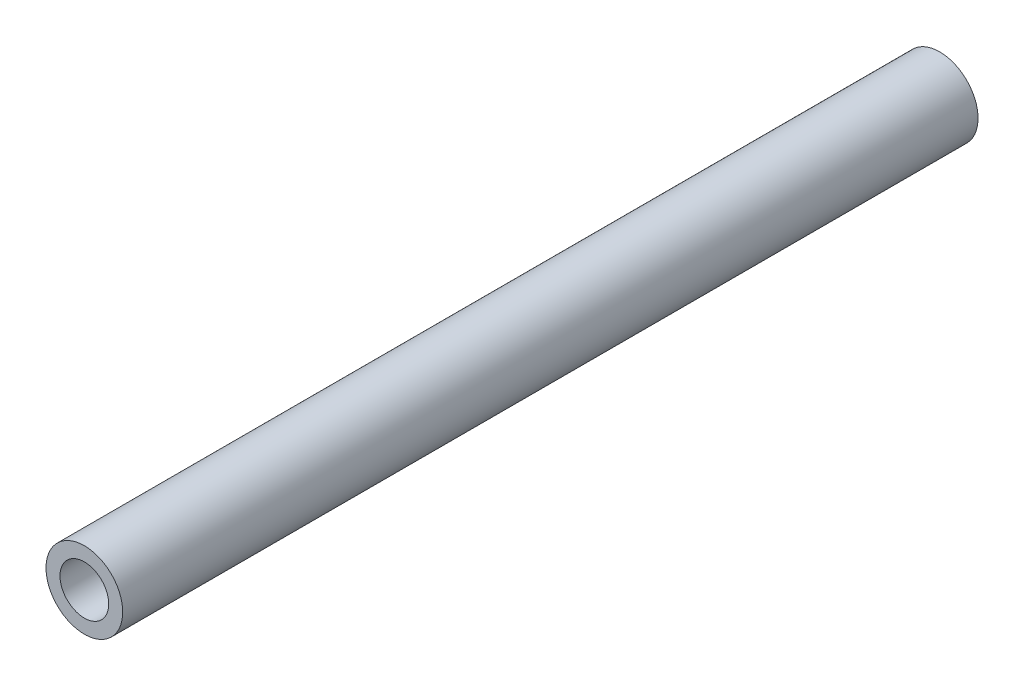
ISO-10303-21;
HEADER;
FILE_DESCRIPTION(('STEP AP214'),'2;1');
FILE_NAME('part.step','',(''),(''),'','','');
FILE_SCHEMA(('AUTOMOTIVE_DESIGN { 1 0 10303 214 1 1 1 1 }'));
ENDSEC;
DATA;
#1=APPLICATION_CONTEXT('core data for automotive mechanical design processes');
#2=APPLICATION_PROTOCOL_DEFINITION('international standard','automotive_design',2000,#1);
#3=PRODUCT_CONTEXT('',#1,'mechanical');
#4=PRODUCT('Part','Part','',(#3));
#5=PRODUCT_RELATED_PRODUCT_CATEGORY('part','',(#4));
#6=PRODUCT_DEFINITION_FORMATION('','',#4);
#7=PRODUCT_DEFINITION_CONTEXT('part definition',#1,'design');
#8=PRODUCT_DEFINITION('design','',#6,#7);
#9=PRODUCT_DEFINITION_SHAPE('','',#8);
#10=(LENGTH_UNIT() NAMED_UNIT(*) SI_UNIT(.MILLI.,.METRE.));
#11=(NAMED_UNIT(*) PLANE_ANGLE_UNIT() SI_UNIT($,.RADIAN.));
#12=(NAMED_UNIT(*) SI_UNIT($,.STERADIAN.) SOLID_ANGLE_UNIT());
#13=UNCERTAINTY_MEASURE_WITH_UNIT(LENGTH_MEASURE(1.E-05),#10,'distance_accuracy_value','');
#14=(GEOMETRIC_REPRESENTATION_CONTEXT(3) GLOBAL_UNCERTAINTY_ASSIGNED_CONTEXT((#13)) GLOBAL_UNIT_ASSIGNED_CONTEXT((#10,
#11,#12)) REPRESENTATION_CONTEXT('',''));
#15=CARTESIAN_POINT('',(0.,0.,0.));
#16=DIRECTION('',(0.,0.,1.));
#17=DIRECTION('',(1.,0.,0.));
#18=AXIS2_PLACEMENT_3D('',#15,#16,#17);
#19=CARTESIAN_POINT('',(0.,0.,111.5));
#20=DIRECTION('',(0.,0.,1.));
#21=DIRECTION('',(1.,0.,0.));
#22=AXIS2_PLACEMENT_3D('',#19,#20,#21);
#23=PLANE('',#22);
#24=CARTESIAN_POINT('',(0.,0.,111.5));
#25=DIRECTION('',(0.,0.,1.));
#26=DIRECTION('',(1.,0.,0.));
#27=AXIS2_PLACEMENT_3D('',#24,#25,#26);
#28=CIRCLE('',#27,5.);
#29=CARTESIAN_POINT('',(-5.,0.,111.5));
#30=VERTEX_POINT('',#29);
#31=EDGE_CURVE('E10',#30,#30,#28,.T.);
#32=ORIENTED_EDGE('',*,*,#31,.T.);
#33=EDGE_LOOP('',(#32));
#34=FACE_BOUND('',#33,.T.);
#35=CARTESIAN_POINT('',(0.,0.,111.5));
#36=DIRECTION('',(0.,0.,1.));
#37=DIRECTION('',(1.,0.,0.));
#38=AXIS2_PLACEMENT_3D('',#35,#36,#37);
#39=CIRCLE('',#38,3.175);
#40=CARTESIAN_POINT('',(-3.175,0.,111.5));
#41=VERTEX_POINT('',#40);
#42=EDGE_CURVE('E40',#41,#41,#39,.T.);
#43=ORIENTED_EDGE('',*,*,#42,.F.);
#44=EDGE_LOOP('',(#43));
#45=FACE_BOUND('',#44,.T.);
#46=ADVANCED_FACE('F29',(#34,#45),#23,.T.);
#47=CARTESIAN_POINT('',(0.,0.,0.));
#48=DIRECTION('',(0.,0.,1.));
#49=DIRECTION('',(1.,0.,0.));
#50=AXIS2_PLACEMENT_3D('',#47,#48,#49);
#51=PLANE('',#50);
#52=CARTESIAN_POINT('',(0.,0.,0.));
#53=DIRECTION('',(0.,0.,1.));
#54=DIRECTION('',(1.,0.,0.));
#55=AXIS2_PLACEMENT_3D('',#52,#53,#54);
#56=CIRCLE('',#55,5.);
#57=CARTESIAN_POINT('',(-5.,0.,0.));
#58=VERTEX_POINT('',#57);
#59=EDGE_CURVE('E33',#58,#58,#56,.T.);
#60=ORIENTED_EDGE('',*,*,#59,.F.);
#61=EDGE_LOOP('',(#60));
#62=FACE_BOUND('',#61,.T.);
#63=CARTESIAN_POINT('',(0.,0.,0.));
#64=DIRECTION('',(0.,0.,1.));
#65=DIRECTION('',(1.,0.,0.));
#66=AXIS2_PLACEMENT_3D('',#63,#64,#65);
#67=CIRCLE('',#66,3.175);
#68=CARTESIAN_POINT('',(-3.175,0.,0.));
#69=VERTEX_POINT('',#68);
#70=EDGE_CURVE('E42',#69,#69,#67,.T.);
#71=ORIENTED_EDGE('',*,*,#70,.T.);
#72=EDGE_LOOP('',(#71));
#73=FACE_BOUND('',#72,.T.);
#74=ADVANCED_FACE('F52',(#62,#73),#51,.F.);
#75=CARTESIAN_POINT('',(0.,0.,111.5));
#76=DIRECTION('',(0.,0.,-1.));
#77=DIRECTION('',(-1.,0.,0.));
#78=AXIS2_PLACEMENT_3D('',#75,#76,#77);
#79=CYLINDRICAL_SURFACE('',#78,5.);
#80=CARTESIAN_POINT('',(-5.,0.,111.5));
#81=CARTESIAN_POINT('',(-5.,0.,110.338541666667));
#82=CARTESIAN_POINT('',(-5.,0.,109.177083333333));
#83=CARTESIAN_POINT('',(-5.,0.,106.854166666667));
#84=CARTESIAN_POINT('',(-5.,0.,105.692708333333));
#85=CARTESIAN_POINT('',(-5.,0.,103.369791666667));
#86=CARTESIAN_POINT('',(-5.,0.,102.208333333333));
#87=CARTESIAN_POINT('',(-5.,0.,99.8854166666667));
#88=CARTESIAN_POINT('',(-5.,0.,98.7239583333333));
#89=CARTESIAN_POINT('',(-5.,0.,96.4010416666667));
#90=CARTESIAN_POINT('',(-5.,0.,95.2395833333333));
#91=CARTESIAN_POINT('',(-5.,0.,92.9166666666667));
#92=CARTESIAN_POINT('',(-5.,0.,91.7552083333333));
#93=CARTESIAN_POINT('',(-5.,0.,89.4322916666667));
#94=CARTESIAN_POINT('',(-5.,0.,88.2708333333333));
#95=CARTESIAN_POINT('',(-5.,0.,85.9479166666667));
#96=CARTESIAN_POINT('',(-5.,0.,84.7864583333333));
#97=CARTESIAN_POINT('',(-5.,0.,82.4635416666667));
#98=CARTESIAN_POINT('',(-5.,0.,81.3020833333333));
#99=CARTESIAN_POINT('',(-5.,0.,78.9791666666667));
#100=CARTESIAN_POINT('',(-5.,0.,77.8177083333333));
#101=CARTESIAN_POINT('',(-5.,0.,75.4947916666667));
#102=CARTESIAN_POINT('',(-5.,0.,74.3333333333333));
#103=CARTESIAN_POINT('',(-5.,0.,72.0104166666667));
#104=CARTESIAN_POINT('',(-5.,0.,70.8489583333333));
#105=CARTESIAN_POINT('',(-5.,0.,68.5260416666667));
#106=CARTESIAN_POINT('',(-5.,0.,67.3645833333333));
#107=CARTESIAN_POINT('',(-5.,0.,65.0416666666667));
#108=CARTESIAN_POINT('',(-5.,0.,63.8802083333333));
#109=CARTESIAN_POINT('',(-5.,0.,61.5572916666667));
#110=CARTESIAN_POINT('',(-5.,0.,60.3958333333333));
#111=CARTESIAN_POINT('',(-5.,0.,58.0729166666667));
#112=CARTESIAN_POINT('',(-5.,0.,56.9114583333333));
#113=CARTESIAN_POINT('',(-5.,0.,54.5885416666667));
#114=CARTESIAN_POINT('',(-5.,0.,53.4270833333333));
#115=CARTESIAN_POINT('',(-5.,0.,51.1041666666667));
#116=CARTESIAN_POINT('',(-5.,0.,49.9427083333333));
#117=CARTESIAN_POINT('',(-5.,0.,47.6197916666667));
#118=CARTESIAN_POINT('',(-5.,0.,46.4583333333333));
#119=CARTESIAN_POINT('',(-5.,0.,44.1354166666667));
#120=CARTESIAN_POINT('',(-5.,0.,42.9739583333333));
#121=CARTESIAN_POINT('',(-5.,0.,40.6510416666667));
#122=CARTESIAN_POINT('',(-5.,0.,39.4895833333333));
#123=CARTESIAN_POINT('',(-5.,0.,37.1666666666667));
#124=CARTESIAN_POINT('',(-5.,0.,36.0052083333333));
#125=CARTESIAN_POINT('',(-5.,0.,33.6822916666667));
#126=CARTESIAN_POINT('',(-5.,0.,32.5208333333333));
#127=CARTESIAN_POINT('',(-5.,0.,30.1979166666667));
#128=CARTESIAN_POINT('',(-5.,0.,29.0364583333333));
#129=CARTESIAN_POINT('',(-5.,0.,26.7135416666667));
#130=CARTESIAN_POINT('',(-5.,0.,25.5520833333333));
#131=CARTESIAN_POINT('',(-5.,0.,23.2291666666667));
#132=CARTESIAN_POINT('',(-5.,0.,22.0677083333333));
#133=CARTESIAN_POINT('',(-5.,0.,19.7447916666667));
#134=CARTESIAN_POINT('',(-5.,0.,18.5833333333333));
#135=CARTESIAN_POINT('',(-5.,0.,16.2604166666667));
#136=CARTESIAN_POINT('',(-5.,0.,15.0989583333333));
#137=CARTESIAN_POINT('',(-5.,0.,12.7760416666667));
#138=CARTESIAN_POINT('',(-5.,0.,11.6145833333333));
#139=CARTESIAN_POINT('',(-5.,0.,9.29166666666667));
#140=CARTESIAN_POINT('',(-5.,0.,8.13020833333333));
#141=CARTESIAN_POINT('',(-5.,0.,5.80729166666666));
#142=CARTESIAN_POINT('',(-5.,0.,4.64583333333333));
#143=CARTESIAN_POINT('',(-5.,0.,2.32291666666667));
#144=CARTESIAN_POINT('',(-5.,0.,1.16145833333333));
#145=CARTESIAN_POINT('',(-5.,0.,0.));
#146=B_SPLINE_CURVE_WITH_KNOTS('',3,(#80,#81,#82,#83,#84,#85,#86,#87,#88,#89,#90,#91,#92,#93,
#94,#95,#96,#97,#98,#99,#100,#101,#102,#103,#104,#105,#106,#107,#108,#109,#110,#111,#112,#113,
#114,#115,#116,#117,#118,#119,#120,#121,#122,#123,#124,#125,#126,#127,#128,#129,#130,#131,#132,
#133,#134,#135,#136,#137,#138,#139,#140,#141,#142,#143,#144,#145),.UNSPECIFIED.,.F.,.F.,(4,2,2,
2,2,2,2,2,2,2,2,2,2,2,2,2,2,2,2,2,2,2,2,2,2,2,2,2,2,2,2,2,4),(0.,3.48437500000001,
6.96875000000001,10.453125,13.9375,17.421875,20.90625,24.390625,27.875,31.359375,34.84375,
38.328125,41.8125,45.296875,48.78125,52.265625,55.75,59.234375,62.71875,66.203125,69.6875,
73.171875,76.65625,80.140625,83.625,87.109375,90.59375,94.078125,97.5625,101.046875,104.53125,
108.015625,111.5),.UNSPECIFIED.);
#147=EDGE_CURVE('BSEAM31',#30,#58,#146,.T.);
#148=ORIENTED_EDGE('',*,*,#31,.F.);
#149=ORIENTED_EDGE('',*,*,#59,.T.);
#150=ORIENTED_EDGE('',*,*,#147,.T.);
#151=ORIENTED_EDGE('',*,*,#147,.F.);
#152=EDGE_LOOP('',(#148,#150,#149,#151));
#153=FACE_BOUND('',#152,.T.);
#154=ADVANCED_FACE('F31',(#153),#79,.T.);
#155=CARTESIAN_POINT('',(0.,0.,111.5));
#156=DIRECTION('',(0.,0.,-1.));
#157=DIRECTION('',(-1.,0.,0.));
#158=AXIS2_PLACEMENT_3D('',#155,#156,#157);
#159=CYLINDRICAL_SURFACE('',#158,3.175);
#160=CARTESIAN_POINT('',(-3.175,0.,111.5));
#161=CARTESIAN_POINT('',(-3.175,0.,110.338541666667));
#162=CARTESIAN_POINT('',(-3.175,0.,109.177083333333));
#163=CARTESIAN_POINT('',(-3.175,0.,106.854166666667));
#164=CARTESIAN_POINT('',(-3.175,0.,105.692708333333));
#165=CARTESIAN_POINT('',(-3.175,0.,103.369791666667));
#166=CARTESIAN_POINT('',(-3.175,0.,102.208333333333));
#167=CARTESIAN_POINT('',(-3.175,0.,99.8854166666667));
#168=CARTESIAN_POINT('',(-3.175,0.,98.7239583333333));
#169=CARTESIAN_POINT('',(-3.175,0.,96.4010416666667));
#170=CARTESIAN_POINT('',(-3.175,0.,95.2395833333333));
#171=CARTESIAN_POINT('',(-3.175,0.,92.9166666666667));
#172=CARTESIAN_POINT('',(-3.175,0.,91.7552083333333));
#173=CARTESIAN_POINT('',(-3.175,0.,89.4322916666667));
#174=CARTESIAN_POINT('',(-3.175,0.,88.2708333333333));
#175=CARTESIAN_POINT('',(-3.175,0.,85.9479166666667));
#176=CARTESIAN_POINT('',(-3.175,0.,84.7864583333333));
#177=CARTESIAN_POINT('',(-3.175,0.,82.4635416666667));
#178=CARTESIAN_POINT('',(-3.175,0.,81.3020833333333));
#179=CARTESIAN_POINT('',(-3.175,0.,78.9791666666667));
#180=CARTESIAN_POINT('',(-3.175,0.,77.8177083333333));
#181=CARTESIAN_POINT('',(-3.175,0.,75.4947916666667));
#182=CARTESIAN_POINT('',(-3.175,0.,74.3333333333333));
#183=CARTESIAN_POINT('',(-3.175,0.,72.0104166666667));
#184=CARTESIAN_POINT('',(-3.175,0.,70.8489583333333));
#185=CARTESIAN_POINT('',(-3.175,0.,68.5260416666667));
#186=CARTESIAN_POINT('',(-3.175,0.,67.3645833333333));
#187=CARTESIAN_POINT('',(-3.175,0.,65.0416666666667));
#188=CARTESIAN_POINT('',(-3.175,0.,63.8802083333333));
#189=CARTESIAN_POINT('',(-3.175,0.,61.5572916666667));
#190=CARTESIAN_POINT('',(-3.175,0.,60.3958333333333));
#191=CARTESIAN_POINT('',(-3.175,0.,58.0729166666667));
#192=CARTESIAN_POINT('',(-3.175,0.,56.9114583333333));
#193=CARTESIAN_POINT('',(-3.175,0.,54.5885416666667));
#194=CARTESIAN_POINT('',(-3.175,0.,53.4270833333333));
#195=CARTESIAN_POINT('',(-3.175,0.,51.1041666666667));
#196=CARTESIAN_POINT('',(-3.175,0.,49.9427083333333));
#197=CARTESIAN_POINT('',(-3.175,0.,47.6197916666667));
#198=CARTESIAN_POINT('',(-3.175,0.,46.4583333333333));
#199=CARTESIAN_POINT('',(-3.175,0.,44.1354166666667));
#200=CARTESIAN_POINT('',(-3.175,0.,42.9739583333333));
#201=CARTESIAN_POINT('',(-3.175,0.,40.6510416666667));
#202=CARTESIAN_POINT('',(-3.175,0.,39.4895833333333));
#203=CARTESIAN_POINT('',(-3.175,0.,37.1666666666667));
#204=CARTESIAN_POINT('',(-3.175,0.,36.0052083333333));
#205=CARTESIAN_POINT('',(-3.175,0.,33.6822916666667));
#206=CARTESIAN_POINT('',(-3.175,0.,32.5208333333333));
#207=CARTESIAN_POINT('',(-3.175,0.,30.1979166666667));
#208=CARTESIAN_POINT('',(-3.175,0.,29.0364583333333));
#209=CARTESIAN_POINT('',(-3.175,0.,26.7135416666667));
#210=CARTESIAN_POINT('',(-3.175,0.,25.5520833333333));
#211=CARTESIAN_POINT('',(-3.175,0.,23.2291666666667));
#212=CARTESIAN_POINT('',(-3.175,0.,22.0677083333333));
#213=CARTESIAN_POINT('',(-3.175,0.,19.7447916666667));
#214=CARTESIAN_POINT('',(-3.175,0.,18.5833333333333));
#215=CARTESIAN_POINT('',(-3.175,0.,16.2604166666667));
#216=CARTESIAN_POINT('',(-3.175,0.,15.0989583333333));
#217=CARTESIAN_POINT('',(-3.175,0.,12.7760416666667));
#218=CARTESIAN_POINT('',(-3.175,0.,11.6145833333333));
#219=CARTESIAN_POINT('',(-3.175,0.,9.29166666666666));
#220=CARTESIAN_POINT('',(-3.175,0.,8.13020833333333));
#221=CARTESIAN_POINT('',(-3.175,0.,5.80729166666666));
#222=CARTESIAN_POINT('',(-3.175,0.,4.64583333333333));
#223=CARTESIAN_POINT('',(-3.175,0.,2.32291666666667));
#224=CARTESIAN_POINT('',(-3.175,0.,1.16145833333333));
#225=CARTESIAN_POINT('',(-3.175,0.,0.));
#226=B_SPLINE_CURVE_WITH_KNOTS('',3,(#160,#161,#162,#163,#164,#165,#166,#167,#168,#169,#170,
#171,#172,#173,#174,#175,#176,#177,#178,#179,#180,#181,#182,#183,#184,#185,#186,#187,#188,#189,
#190,#191,#192,#193,#194,#195,#196,#197,#198,#199,#200,#201,#202,#203,#204,#205,#206,#207,#208,
#209,#210,#211,#212,#213,#214,#215,#216,#217,#218,#219,#220,#221,#222,#223,#224,#225),
.UNSPECIFIED.,.F.,.F.,(4,2,2,2,2,2,2,2,2,2,2,2,2,2,2,2,2,2,2,2,2,2,2,2,2,2,2,2,2,2,2,2,4),(0.,
3.484375,6.96875,10.453125,13.9375,17.421875,20.90625,24.390625,27.875,31.359375,34.84375,
38.328125,41.8125,45.296875,48.78125,52.265625,55.75,59.234375,62.71875,66.203125,69.6875,
73.171875,76.65625,80.140625,83.625,87.109375,90.59375,94.078125,97.5625,101.046875,104.53125,
108.015625,111.5),.UNSPECIFIED.);
#227=EDGE_CURVE('BSEAM48',#41,#69,#226,.T.);
#228=ORIENTED_EDGE('',*,*,#42,.T.);
#229=ORIENTED_EDGE('',*,*,#70,.F.);
#230=ORIENTED_EDGE('',*,*,#227,.T.);
#231=ORIENTED_EDGE('',*,*,#227,.F.);
#232=EDGE_LOOP('',(#228,#230,#229,#231));
#233=FACE_BOUND('',#232,.T.);
#234=ADVANCED_FACE('F48',(#233),#159,.F.);
#235=CLOSED_SHELL('',(#46,#74,#154,#234));
#236=MANIFOLD_SOLID_BREP('B2',#235);
#237=ADVANCED_BREP_SHAPE_REPRESENTATION('',(#18,#236),#14);
#238=SHAPE_DEFINITION_REPRESENTATION(#9,#237);
ENDSEC;
END-ISO-10303-21;
